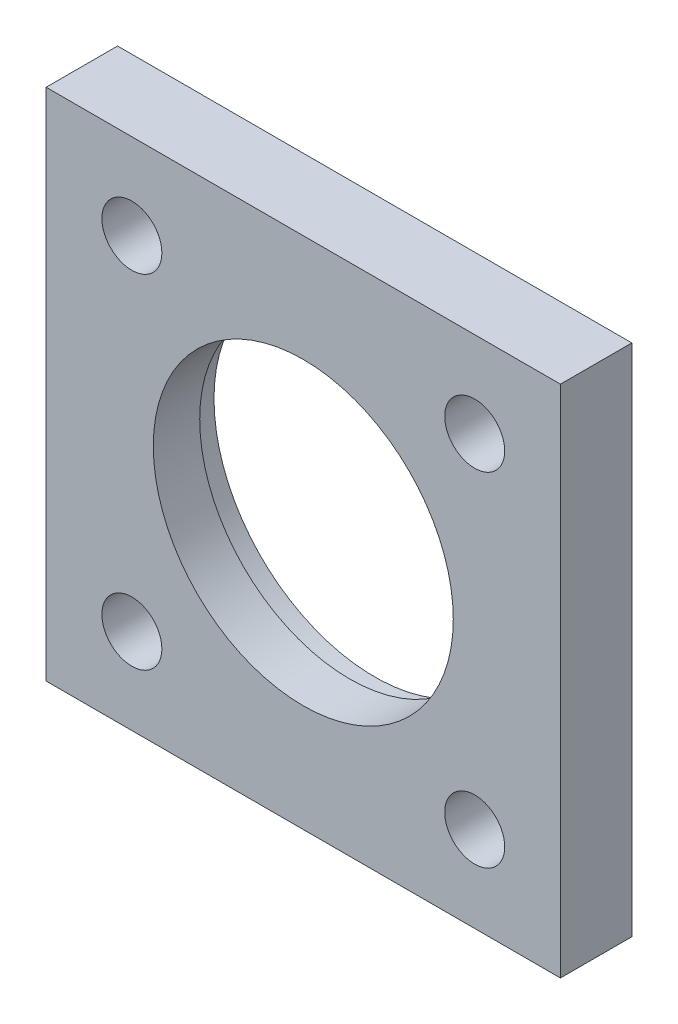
ISO-10303-21;
HEADER;
FILE_DESCRIPTION(('STEP AP214'),'2;1');
FILE_NAME('part.step','',(''),(''),'','','');
FILE_SCHEMA(('AUTOMOTIVE_DESIGN { 1 0 10303 214 1 1 1 1 }'));
ENDSEC;
DATA;
#1=APPLICATION_CONTEXT('core data for automotive mechanical design processes');
#2=APPLICATION_PROTOCOL_DEFINITION('international standard','automotive_design',2000,#1);
#3=PRODUCT_CONTEXT('',#1,'mechanical');
#4=PRODUCT('Part','Part','',(#3));
#5=PRODUCT_RELATED_PRODUCT_CATEGORY('part','',(#4));
#6=PRODUCT_DEFINITION_FORMATION('','',#4);
#7=PRODUCT_DEFINITION_CONTEXT('part definition',#1,'design');
#8=PRODUCT_DEFINITION('design','',#6,#7);
#9=PRODUCT_DEFINITION_SHAPE('','',#8);
#10=(LENGTH_UNIT() NAMED_UNIT(*) SI_UNIT(.MILLI.,.METRE.));
#11=(NAMED_UNIT(*) PLANE_ANGLE_UNIT() SI_UNIT($,.RADIAN.));
#12=(NAMED_UNIT(*) SI_UNIT($,.STERADIAN.) SOLID_ANGLE_UNIT());
#13=UNCERTAINTY_MEASURE_WITH_UNIT(LENGTH_MEASURE(1.E-05),#10,'distance_accuracy_value','');
#14=(GEOMETRIC_REPRESENTATION_CONTEXT(3) GLOBAL_UNCERTAINTY_ASSIGNED_CONTEXT((#13)) GLOBAL_UNIT_ASSIGNED_CONTEXT((#10,
#11,#12)) REPRESENTATION_CONTEXT('',''));
#15=CARTESIAN_POINT('',(0.,0.,0.));
#16=DIRECTION('',(0.,0.,1.));
#17=DIRECTION('',(1.,0.,0.));
#18=AXIS2_PLACEMENT_3D('',#15,#16,#17);
#19=CARTESIAN_POINT('',(-36.,36.,10.));
#20=DIRECTION('',(1.,0.,0.));
#21=DIRECTION('',(0.,0.,-1.));
#22=AXIS2_PLACEMENT_3D('',#19,#20,#21);
#23=PLANE('',#22);
#24=DIRECTION('',(0.,-1.,0.));
#25=VECTOR('',#24,1.);
#26=CARTESIAN_POINT('',(-36.,36.,0.));
#27=LINE('',#26,#25);
#28=CARTESIAN_POINT('',(-36.,36.,0.));
#29=VERTEX_POINT('',#28);
#30=CARTESIAN_POINT('',(-36.,-36.,0.));
#31=VERTEX_POINT('',#30);
#32=EDGE_CURVE('E394',#29,#31,#27,.T.);
#33=ORIENTED_EDGE('',*,*,#32,.T.);
#34=DIRECTION('',(0.,0.,-1.));
#35=VECTOR('',#34,1.);
#36=CARTESIAN_POINT('',(-36.,-36.,10.));
#37=LINE('',#36,#35);
#38=CARTESIAN_POINT('',(-36.,-36.,10.));
#39=VERTEX_POINT('',#38);
#40=EDGE_CURVE('E11',#39,#31,#37,.T.);
#41=ORIENTED_EDGE('',*,*,#40,.F.);
#42=DIRECTION('',(0.,-1.,0.));
#43=VECTOR('',#42,1.);
#44=CARTESIAN_POINT('',(-36.,36.,10.));
#45=LINE('',#44,#43);
#46=CARTESIAN_POINT('',(-36.,36.,10.));
#47=VERTEX_POINT('',#46);
#48=EDGE_CURVE('E417',#47,#39,#45,.T.);
#49=ORIENTED_EDGE('',*,*,#48,.F.);
#50=DIRECTION('',(0.,0.,-1.));
#51=VECTOR('',#50,1.);
#52=CARTESIAN_POINT('',(-36.,36.,10.));
#53=LINE('',#52,#51);
#54=EDGE_CURVE('E406',#47,#29,#53,.T.);
#55=ORIENTED_EDGE('',*,*,#54,.T.);
#56=EDGE_LOOP('',(#33,#41,#49,#55));
#57=FACE_BOUND('',#56,.T.);
#58=ADVANCED_FACE('F350',(#57),#23,.F.);
#59=CARTESIAN_POINT('',(-36.,-36.,10.));
#60=DIRECTION('',(0.,1.,0.));
#61=DIRECTION('',(0.,0.,1.));
#62=AXIS2_PLACEMENT_3D('',#59,#60,#61);
#63=PLANE('',#62);
#64=DIRECTION('',(1.,0.,0.));
#65=VECTOR('',#64,1.);
#66=CARTESIAN_POINT('',(-36.,-36.,0.));
#67=LINE('',#66,#65);
#68=CARTESIAN_POINT('',(36.,-36.,0.));
#69=VERTEX_POINT('',#68);
#70=EDGE_CURVE('E390',#31,#69,#67,.T.);
#71=ORIENTED_EDGE('',*,*,#70,.T.);
#72=DIRECTION('',(0.,0.,-1.));
#73=VECTOR('',#72,1.);
#74=CARTESIAN_POINT('',(36.,-36.,10.));
#75=LINE('',#74,#73);
#76=CARTESIAN_POINT('',(36.,-36.,10.));
#77=VERTEX_POINT('',#76);
#78=EDGE_CURVE('E357',#77,#69,#75,.T.);
#79=ORIENTED_EDGE('',*,*,#78,.F.);
#80=DIRECTION('',(1.,0.,0.));
#81=VECTOR('',#80,1.);
#82=CARTESIAN_POINT('',(-36.,-36.,10.));
#83=LINE('',#82,#81);
#84=EDGE_CURVE('E402',#39,#77,#83,.T.);
#85=ORIENTED_EDGE('',*,*,#84,.F.);
#86=ORIENTED_EDGE('',*,*,#40,.T.);
#87=EDGE_LOOP('',(#71,#79,#85,#86));
#88=FACE_BOUND('',#87,.T.);
#89=ADVANCED_FACE('F401',(#88),#63,.F.);
#90=CARTESIAN_POINT('',(36.,36.,10.));
#91=DIRECTION('',(-1.,0.,0.));
#92=DIRECTION('',(0.,0.,1.));
#93=AXIS2_PLACEMENT_3D('',#90,#91,#92);
#94=PLANE('',#93);
#95=DIRECTION('',(0.,1.,0.));
#96=VECTOR('',#95,1.);
#97=CARTESIAN_POINT('',(36.,36.,0.));
#98=LINE('',#97,#96);
#99=CARTESIAN_POINT('',(36.,36.,0.));
#100=VERTEX_POINT('',#99);
#101=EDGE_CURVE('E395',#69,#100,#98,.T.);
#102=ORIENTED_EDGE('',*,*,#101,.T.);
#103=DIRECTION('',(0.,0.,-1.));
#104=VECTOR('',#103,1.);
#105=CARTESIAN_POINT('',(36.,36.,10.));
#106=LINE('',#105,#104);
#107=CARTESIAN_POINT('',(36.,36.,10.));
#108=VERTEX_POINT('',#107);
#109=EDGE_CURVE('E423',#108,#100,#106,.T.);
#110=ORIENTED_EDGE('',*,*,#109,.F.);
#111=DIRECTION('',(0.,1.,0.));
#112=VECTOR('',#111,1.);
#113=CARTESIAN_POINT('',(36.,36.,10.));
#114=LINE('',#113,#112);
#115=EDGE_CURVE('E369',#77,#108,#114,.T.);
#116=ORIENTED_EDGE('',*,*,#115,.F.);
#117=ORIENTED_EDGE('',*,*,#78,.T.);
#118=EDGE_LOOP('',(#102,#110,#116,#117));
#119=FACE_BOUND('',#118,.T.);
#120=ADVANCED_FACE('F426',(#119),#94,.F.);
#121=CARTESIAN_POINT('',(-36.,36.,10.));
#122=DIRECTION('',(0.,-1.,0.));
#123=DIRECTION('',(0.,0.,-1.));
#124=AXIS2_PLACEMENT_3D('',#121,#122,#123);
#125=PLANE('',#124);
#126=DIRECTION('',(-1.,0.,0.));
#127=VECTOR('',#126,1.);
#128=CARTESIAN_POINT('',(-36.,36.,0.));
#129=LINE('',#128,#127);
#130=EDGE_CURVE('E415',#100,#29,#129,.T.);
#131=ORIENTED_EDGE('',*,*,#130,.T.);
#132=ORIENTED_EDGE('',*,*,#54,.F.);
#133=DIRECTION('',(-1.,0.,0.));
#134=VECTOR('',#133,1.);
#135=CARTESIAN_POINT('',(-36.,36.,10.));
#136=LINE('',#135,#134);
#137=EDGE_CURVE('E364',#108,#47,#136,.T.);
#138=ORIENTED_EDGE('',*,*,#137,.F.);
#139=ORIENTED_EDGE('',*,*,#109,.T.);
#140=EDGE_LOOP('',(#131,#132,#138,#139));
#141=FACE_BOUND('',#140,.T.);
#142=ADVANCED_FACE('F428',(#141),#125,.F.);
#143=CARTESIAN_POINT('',(-36.,-36.,10.));
#144=DIRECTION('',(0.,0.,1.));
#145=DIRECTION('',(1.,0.,0.));
#146=AXIS2_PLACEMENT_3D('',#143,#144,#145);
#147=PLANE('',#146);
#148=CARTESIAN_POINT('',(-24.,24.,10.));
#149=DIRECTION('',(0.,0.,1.));
#150=DIRECTION('',(1.,0.,0.));
#151=AXIS2_PLACEMENT_3D('',#148,#149,#150);
#152=CIRCLE('',#151,4.19999999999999);
#153=CARTESIAN_POINT('',(-19.8,24.,10.));
#154=VERTEX_POINT('',#153);
#155=EDGE_CURVE('E529',#154,#154,#152,.T.);
#156=ORIENTED_EDGE('',*,*,#155,.F.);
#157=EDGE_LOOP('',(#156));
#158=FACE_BOUND('',#157,.T.);
#159=CARTESIAN_POINT('',(24.,-24.,10.));
#160=DIRECTION('',(0.,0.,1.));
#161=DIRECTION('',(1.,0.,0.));
#162=AXIS2_PLACEMENT_3D('',#159,#160,#161);
#163=CIRCLE('',#162,4.19999999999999);
#164=CARTESIAN_POINT('',(28.2,-24.,10.));
#165=VERTEX_POINT('',#164);
#166=EDGE_CURVE('E531',#165,#165,#163,.T.);
#167=ORIENTED_EDGE('',*,*,#166,.F.);
#168=EDGE_LOOP('',(#167));
#169=FACE_BOUND('',#168,.T.);
#170=CARTESIAN_POINT('',(-24.,-24.,10.));
#171=DIRECTION('',(0.,0.,1.));
#172=DIRECTION('',(1.,0.,0.));
#173=AXIS2_PLACEMENT_3D('',#170,#171,#172);
#174=CIRCLE('',#173,4.19999999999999);
#175=CARTESIAN_POINT('',(-19.8,-24.,10.));
#176=VERTEX_POINT('',#175);
#177=EDGE_CURVE('E539',#176,#176,#174,.T.);
#178=ORIENTED_EDGE('',*,*,#177,.F.);
#179=EDGE_LOOP('',(#178));
#180=FACE_BOUND('',#179,.T.);
#181=CARTESIAN_POINT('',(24.,24.,10.));
#182=DIRECTION('',(0.,0.,1.));
#183=DIRECTION('',(1.,0.,0.));
#184=AXIS2_PLACEMENT_3D('',#181,#182,#183);
#185=CIRCLE('',#184,4.19999999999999);
#186=CARTESIAN_POINT('',(28.2,24.,10.));
#187=VERTEX_POINT('',#186);
#188=EDGE_CURVE('E545',#187,#187,#185,.T.);
#189=ORIENTED_EDGE('',*,*,#188,.F.);
#190=EDGE_LOOP('',(#189));
#191=FACE_BOUND('',#190,.T.);
#192=CARTESIAN_POINT('',(0.,0.,10.));
#193=DIRECTION('',(0.,0.,-1.));
#194=DIRECTION('',(-1.,0.,0.));
#195=AXIS2_PLACEMENT_3D('',#192,#193,#194);
#196=CIRCLE('',#195,21.);
#197=CARTESIAN_POINT('',(-21.,0.,10.));
#198=VERTEX_POINT('',#197);
#199=EDGE_CURVE('E551',#198,#198,#196,.T.);
#200=ORIENTED_EDGE('',*,*,#199,.T.);
#201=EDGE_LOOP('',(#200));
#202=FACE_BOUND('',#201,.T.);
#203=ORIENTED_EDGE('',*,*,#48,.T.);
#204=ORIENTED_EDGE('',*,*,#84,.T.);
#205=ORIENTED_EDGE('',*,*,#115,.T.);
#206=ORIENTED_EDGE('',*,*,#137,.T.);
#207=EDGE_LOOP('',(#203,#204,#205,#206));
#208=FACE_BOUND('',#207,.T.);
#209=ADVANCED_FACE('F429',(#158,#169,#180,#191,#202,#208),#147,.T.);
#210=CARTESIAN_POINT('',(-36.,-36.,0.));
#211=DIRECTION('',(0.,0.,1.));
#212=DIRECTION('',(1.,0.,0.));
#213=AXIS2_PLACEMENT_3D('',#210,#211,#212);
#214=PLANE('',#213);
#215=CARTESIAN_POINT('',(-24.,24.,0.));
#216=DIRECTION('',(0.,0.,1.));
#217=DIRECTION('',(1.,0.,0.));
#218=AXIS2_PLACEMENT_3D('',#215,#216,#217);
#219=CIRCLE('',#218,4.2);
#220=CARTESIAN_POINT('',(-19.8,24.,0.));
#221=VERTEX_POINT('',#220);
#222=EDGE_CURVE('E527',#221,#221,#219,.T.);
#223=ORIENTED_EDGE('',*,*,#222,.T.);
#224=EDGE_LOOP('',(#223));
#225=FACE_BOUND('',#224,.T.);
#226=CARTESIAN_POINT('',(24.,-24.,0.));
#227=DIRECTION('',(0.,0.,1.));
#228=DIRECTION('',(1.,0.,0.));
#229=AXIS2_PLACEMENT_3D('',#226,#227,#228);
#230=CIRCLE('',#229,4.2);
#231=CARTESIAN_POINT('',(28.2,-24.,0.));
#232=VERTEX_POINT('',#231);
#233=EDGE_CURVE('E536',#232,#232,#230,.T.);
#234=ORIENTED_EDGE('',*,*,#233,.T.);
#235=EDGE_LOOP('',(#234));
#236=FACE_BOUND('',#235,.T.);
#237=CARTESIAN_POINT('',(-24.,-24.,0.));
#238=DIRECTION('',(0.,0.,1.));
#239=DIRECTION('',(1.,0.,0.));
#240=AXIS2_PLACEMENT_3D('',#237,#238,#239);
#241=CIRCLE('',#240,4.2);
#242=CARTESIAN_POINT('',(-19.8,-24.,0.));
#243=VERTEX_POINT('',#242);
#244=EDGE_CURVE('E542',#243,#243,#241,.T.);
#245=ORIENTED_EDGE('',*,*,#244,.T.);
#246=EDGE_LOOP('',(#245));
#247=FACE_BOUND('',#246,.T.);
#248=CARTESIAN_POINT('',(24.,24.,0.));
#249=DIRECTION('',(0.,0.,1.));
#250=DIRECTION('',(1.,0.,0.));
#251=AXIS2_PLACEMENT_3D('',#248,#249,#250);
#252=CIRCLE('',#251,4.2);
#253=CARTESIAN_POINT('',(28.2,24.,0.));
#254=VERTEX_POINT('',#253);
#255=EDGE_CURVE('E548',#254,#254,#252,.T.);
#256=ORIENTED_EDGE('',*,*,#255,.T.);
#257=EDGE_LOOP('',(#256));
#258=FACE_BOUND('',#257,.T.);
#259=CARTESIAN_POINT('',(0.,0.,0.));
#260=DIRECTION('',(0.,0.,-1.));
#261=DIRECTION('',(-1.,0.,0.));
#262=AXIS2_PLACEMENT_3D('',#259,#260,#261);
#263=CIRCLE('',#262,22.5);
#264=CARTESIAN_POINT('',(-22.5,0.,0.));
#265=VERTEX_POINT('',#264);
#266=EDGE_CURVE('E407',#265,#265,#263,.T.);
#267=ORIENTED_EDGE('',*,*,#266,.F.);
#268=EDGE_LOOP('',(#267));
#269=FACE_BOUND('',#268,.T.);
#270=ORIENTED_EDGE('',*,*,#32,.F.);
#271=ORIENTED_EDGE('',*,*,#130,.F.);
#272=ORIENTED_EDGE('',*,*,#101,.F.);
#273=ORIENTED_EDGE('',*,*,#70,.F.);
#274=EDGE_LOOP('',(#270,#271,#272,#273));
#275=FACE_BOUND('',#274,.T.);
#276=ADVANCED_FACE('F391',(#225,#236,#247,#258,#269,#275),#214,.F.);
#277=CARTESIAN_POINT('',(0.,0.,0.));
#278=DIRECTION('',(0.,0.,-1.));
#279=DIRECTION('',(-1.,0.,0.));
#280=AXIS2_PLACEMENT_3D('',#277,#278,#279);
#281=CYLINDRICAL_SURFACE('',#280,22.5);
#282=CARTESIAN_POINT('',(0.,0.,3.5));
#283=DIRECTION('',(0.,0.,-1.));
#284=DIRECTION('',(-1.,0.,0.));
#285=AXIS2_PLACEMENT_3D('',#282,#283,#284);
#286=CIRCLE('',#285,22.5);
#287=CARTESIAN_POINT('',(-22.5,0.,3.5));
#288=VERTEX_POINT('',#287);
#289=EDGE_CURVE('E410',#288,#288,#286,.T.);
#290=ORIENTED_EDGE('',*,*,#289,.F.);
#291=EDGE_LOOP('',(#290));
#292=FACE_BOUND('',#291,.T.);
#293=ORIENTED_EDGE('',*,*,#266,.T.);
#294=EDGE_LOOP('',(#293));
#295=FACE_BOUND('',#294,.T.);
#296=ADVANCED_FACE('F437',(#292,#295),#281,.F.);
#297=CARTESIAN_POINT('',(0.,22.5,3.5));
#298=DIRECTION('',(0.,0.,1.));
#299=DIRECTION('',(1.,0.,0.));
#300=AXIS2_PLACEMENT_3D('',#297,#298,#299);
#301=PLANE('',#300);
#302=CARTESIAN_POINT('',(0.,0.,3.5));
#303=DIRECTION('',(0.,0.,-1.));
#304=DIRECTION('',(-1.,0.,0.));
#305=AXIS2_PLACEMENT_3D('',#302,#303,#304);
#306=CIRCLE('',#305,21.);
#307=CARTESIAN_POINT('',(-21.,0.,3.5));
#308=VERTEX_POINT('',#307);
#309=EDGE_CURVE('E554',#308,#308,#306,.T.);
#310=ORIENTED_EDGE('',*,*,#309,.F.);
#311=EDGE_LOOP('',(#310));
#312=FACE_BOUND('',#311,.T.);
#313=ORIENTED_EDGE('',*,*,#289,.T.);
#314=EDGE_LOOP('',(#313));
#315=FACE_BOUND('',#314,.T.);
#316=ADVANCED_FACE('F473',(#312,#315),#301,.F.);
#317=CARTESIAN_POINT('',(0.,0.,0.));
#318=DIRECTION('',(0.,0.,-1.));
#319=DIRECTION('',(-1.,0.,0.));
#320=AXIS2_PLACEMENT_3D('',#317,#318,#319);
#321=CYLINDRICAL_SURFACE('',#320,21.);
#322=ORIENTED_EDGE('',*,*,#199,.F.);
#323=EDGE_LOOP('',(#322));
#324=FACE_BOUND('',#323,.T.);
#325=ORIENTED_EDGE('',*,*,#309,.T.);
#326=EDGE_LOOP('',(#325));
#327=FACE_BOUND('',#326,.T.);
#328=ADVANCED_FACE('F481',(#324,#327),#321,.F.);
#329=CARTESIAN_POINT('',(24.,24.,10.));
#330=DIRECTION('',(0.,0.,1.));
#331=DIRECTION('',(1.,0.,0.));
#332=AXIS2_PLACEMENT_3D('',#329,#330,#331);
#333=CYLINDRICAL_SURFACE('',#332,4.19999999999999);
#334=ORIENTED_EDGE('',*,*,#255,.F.);
#335=EDGE_LOOP('',(#334));
#336=FACE_BOUND('',#335,.T.);
#337=ORIENTED_EDGE('',*,*,#188,.T.);
#338=EDGE_LOOP('',(#337));
#339=FACE_BOUND('',#338,.T.);
#340=ADVANCED_FACE('F489',(#336,#339),#333,.F.);
#341=CARTESIAN_POINT('',(-24.,-24.,10.));
#342=DIRECTION('',(0.,0.,1.));
#343=DIRECTION('',(1.,0.,0.));
#344=AXIS2_PLACEMENT_3D('',#341,#342,#343);
#345=CYLINDRICAL_SURFACE('',#344,4.19999999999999);
#346=ORIENTED_EDGE('',*,*,#244,.F.);
#347=EDGE_LOOP('',(#346));
#348=FACE_BOUND('',#347,.T.);
#349=ORIENTED_EDGE('',*,*,#177,.T.);
#350=EDGE_LOOP('',(#349));
#351=FACE_BOUND('',#350,.T.);
#352=ADVANCED_FACE('F497',(#348,#351),#345,.F.);
#353=CARTESIAN_POINT('',(24.,-24.,10.));
#354=DIRECTION('',(0.,0.,1.));
#355=DIRECTION('',(1.,0.,0.));
#356=AXIS2_PLACEMENT_3D('',#353,#354,#355);
#357=CYLINDRICAL_SURFACE('',#356,4.19999999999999);
#358=ORIENTED_EDGE('',*,*,#233,.F.);
#359=EDGE_LOOP('',(#358));
#360=FACE_BOUND('',#359,.T.);
#361=ORIENTED_EDGE('',*,*,#166,.T.);
#362=EDGE_LOOP('',(#361));
#363=FACE_BOUND('',#362,.T.);
#364=ADVANCED_FACE('F505',(#360,#363),#357,.F.);
#365=CARTESIAN_POINT('',(-24.,24.,10.));
#366=DIRECTION('',(0.,0.,1.));
#367=DIRECTION('',(1.,0.,0.));
#368=AXIS2_PLACEMENT_3D('',#365,#366,#367);
#369=CYLINDRICAL_SURFACE('',#368,4.19999999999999);
#370=ORIENTED_EDGE('',*,*,#222,.F.);
#371=EDGE_LOOP('',(#370));
#372=FACE_BOUND('',#371,.T.);
#373=ORIENTED_EDGE('',*,*,#155,.T.);
#374=EDGE_LOOP('',(#373));
#375=FACE_BOUND('',#374,.T.);
#376=ADVANCED_FACE('F513',(#372,#375),#369,.F.);
#377=CLOSED_SHELL('',(#58,#89,#120,#142,#209,#276,#296,#316,#328,#340,#352,#364,#376));
#378=MANIFOLD_SOLID_BREP('B2',#377);
#379=ADVANCED_BREP_SHAPE_REPRESENTATION('',(#18,#378),#14);
#380=SHAPE_DEFINITION_REPRESENTATION(#9,#379);
ENDSEC;
END-ISO-10303-21;
